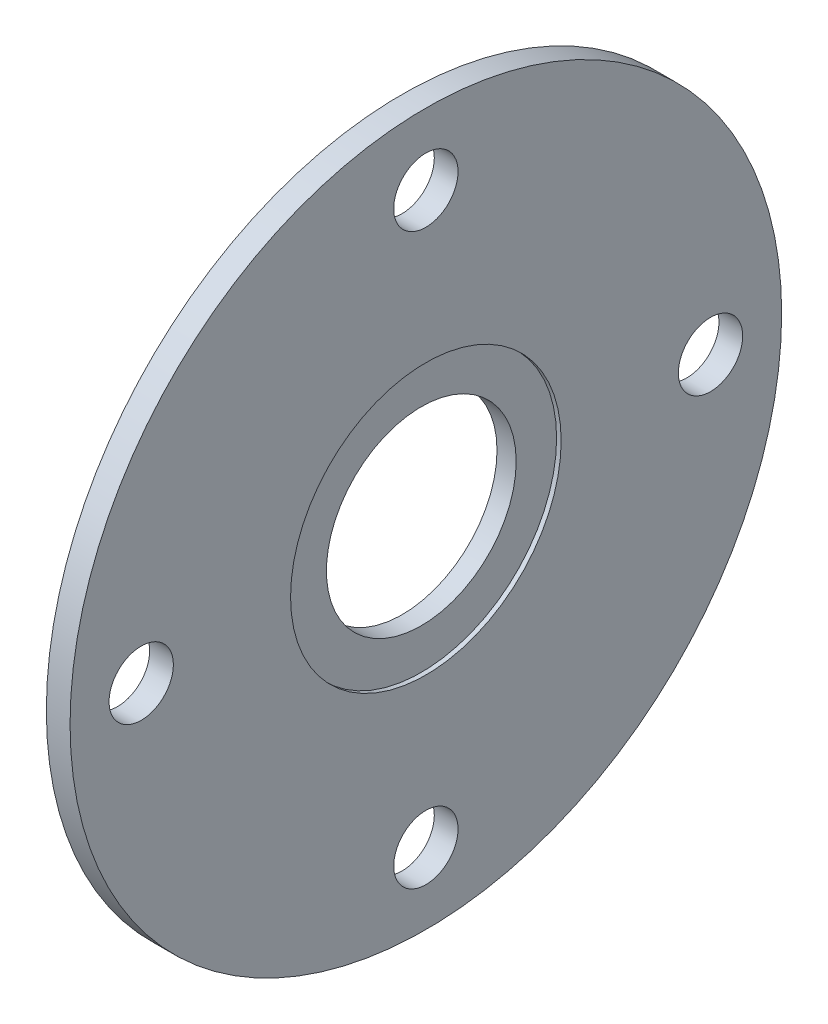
from build123d import *

# Parameters (mm, degrees)
SKETCH1_R           = 23.8125
SKETCH1_R_2         = 6.35
SKETCH1_R_3         = 2.15265
BOSS_EXTRUDE1_DEPTH = 1.5875
SKETCH2_R           = 9.0551
CUT_EXTRUDE1_DEPTH  = 0.3048


with BuildPart() as part:
    # Sketch1 → Boss-Extrude1 (new body)
    with BuildSketch(Plane(origin=(0, 0, 0), x_dir=(0, 0, -1), z_dir=(1, 0, 0))):
        Circle(SKETCH1_R)
        Circle(SKETCH1_R_2, mode=Mode.SUBTRACT)
        with Locations((0, 19.05)):
            Circle(SKETCH1_R_3, mode=Mode.SUBTRACT)
        with Locations((19.05, 0)):
            Circle(SKETCH1_R_3, mode=Mode.SUBTRACT)
        with Locations((0, -19.05)):
            Circle(SKETCH1_R_3, mode=Mode.SUBTRACT)
        with Locations((-19.05, 0)):
            Circle(SKETCH1_R_3, mode=Mode.SUBTRACT)
    extrude(amount=BOSS_EXTRUDE1_DEPTH)

    # Sketch2 → Cut-Extrude1 (cut)
    with BuildSketch(Plane(origin=(1.5875, 0, 0), x_dir=(0, 0, -1), z_dir=(1, 0, 0))):
        Circle(SKETCH2_R)
    extrude(amount=-CUT_EXTRUDE1_DEPTH, mode=Mode.SUBTRACT)


solid = part.part
